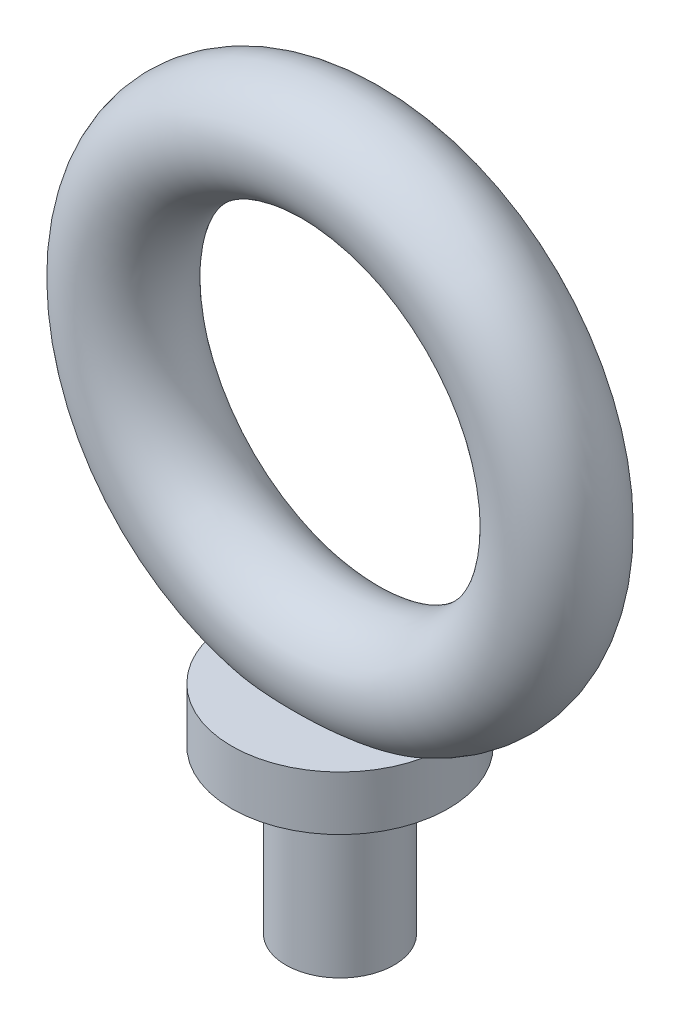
ISO-10303-21;
HEADER;
FILE_DESCRIPTION(('STEP AP214'),'2;1');
FILE_NAME('part.step','',(''),(''),'','','');
FILE_SCHEMA(('AUTOMOTIVE_DESIGN { 1 0 10303 214 1 1 1 1 }'));
ENDSEC;
DATA;
#1=APPLICATION_CONTEXT('core data for automotive mechanical design processes');
#2=APPLICATION_PROTOCOL_DEFINITION('international standard','automotive_design',2000,#1);
#3=PRODUCT_CONTEXT('',#1,'mechanical');
#4=PRODUCT('Part','Part','',(#3));
#5=PRODUCT_RELATED_PRODUCT_CATEGORY('part','',(#4));
#6=PRODUCT_DEFINITION_FORMATION('','',#4);
#7=PRODUCT_DEFINITION_CONTEXT('part definition',#1,'design');
#8=PRODUCT_DEFINITION('design','',#6,#7);
#9=PRODUCT_DEFINITION_SHAPE('','',#8);
#10=(LENGTH_UNIT() NAMED_UNIT(*) SI_UNIT(.MILLI.,.METRE.));
#11=(NAMED_UNIT(*) PLANE_ANGLE_UNIT() SI_UNIT($,.RADIAN.));
#12=(NAMED_UNIT(*) SI_UNIT($,.STERADIAN.) SOLID_ANGLE_UNIT());
#13=UNCERTAINTY_MEASURE_WITH_UNIT(LENGTH_MEASURE(1.E-05),#10,'distance_accuracy_value','');
#14=(GEOMETRIC_REPRESENTATION_CONTEXT(3) GLOBAL_UNCERTAINTY_ASSIGNED_CONTEXT((#13)) GLOBAL_UNIT_ASSIGNED_CONTEXT((#10,
#11,#12)) REPRESENTATION_CONTEXT('',''));
#15=CARTESIAN_POINT('',(0.,0.,0.));
#16=DIRECTION('',(0.,0.,1.));
#17=DIRECTION('',(1.,0.,0.));
#18=AXIS2_PLACEMENT_3D('',#15,#16,#17);
#19=CARTESIAN_POINT('',(0.,19.05,0.));
#20=DIRECTION('',(0.,1.,0.));
#21=DIRECTION('',(0.,0.,1.));
#22=AXIS2_PLACEMENT_3D('',#19,#20,#21);
#23=CYLINDRICAL_SURFACE('',#22,12.7);
#24=CARTESIAN_POINT('',(0.,19.05,0.));
#25=DIRECTION('',(0.,1.,0.));
#26=DIRECTION('',(0.,0.,1.));
#27=AXIS2_PLACEMENT_3D('',#24,#25,#26);
#28=CIRCLE('',#27,12.7);
#29=CARTESIAN_POINT('',(0.,19.05,12.7));
#30=VERTEX_POINT('',#29);
#31=EDGE_CURVE('E77',#30,#30,#28,.T.);
#32=ORIENTED_EDGE('',*,*,#31,.T.);
#33=EDGE_LOOP('',(#32));
#34=FACE_BOUND('',#33,.T.);
#35=CARTESIAN_POINT('',(0.,25.4,0.));
#36=DIRECTION('',(0.,1.,0.));
#37=DIRECTION('',(0.,0.,1.));
#38=AXIS2_PLACEMENT_3D('',#35,#36,#37);
#39=CIRCLE('',#38,12.7);
#40=CARTESIAN_POINT('',(12.4130547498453,25.4,-2.68441274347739));
#41=VERTEX_POINT('',#40);
#42=CARTESIAN_POINT('',(-12.4130547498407,25.4000000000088,-2.68441274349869));
#43=VERTEX_POINT('',#42);
#44=EDGE_CURVE('E73',#41,#43,#39,.T.);
#45=ORIENTED_EDGE('',*,*,#44,.F.);
#46=CARTESIAN_POINT('',(12.4129504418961,25.4002,-2.68489503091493));
#47=CARTESIAN_POINT('',(12.4478696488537,25.3332914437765,-2.52358993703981));
#48=CARTESIAN_POINT('',(12.4801273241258,25.2726602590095,-2.35910719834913));
#49=CARTESIAN_POINT('',(12.5386641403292,25.1641082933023,-2.02496324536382));
#50=CARTESIAN_POINT('',(12.5649432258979,25.1161876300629,-1.85530198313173));
#51=CARTESIAN_POINT('',(12.6108572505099,25.0332307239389,-1.51205162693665));
#52=CARTESIAN_POINT('',(12.6304949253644,24.9981891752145,-1.33846418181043));
#53=CARTESIAN_POINT('',(12.6626879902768,24.941074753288,-0.988529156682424));
#54=CARTESIAN_POINT('',(12.6752437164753,24.9190012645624,-0.812181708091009));
#55=CARTESIAN_POINT('',(12.6929873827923,24.8878788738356,-0.457798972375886));
#56=CARTESIAN_POINT('',(12.6981681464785,24.8788426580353,-0.279762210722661));
#57=CARTESIAN_POINT('',(12.7010189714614,24.8738651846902,0.0765535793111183));
#58=CARTESIAN_POINT('',(12.6986890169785,24.8779239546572,0.254832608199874));
#59=CARTESIAN_POINT('',(12.686576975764,24.8991146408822,0.610193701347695));
#60=CARTESIAN_POINT('',(12.676801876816,24.916234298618,0.787276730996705));
#61=CARTESIAN_POINT('',(12.6500444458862,24.9634617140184,1.13908131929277));
#62=CARTESIAN_POINT('',(12.6330641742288,24.9935657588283,1.31380353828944));
#63=CARTESIAN_POINT('',(12.5883676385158,25.0736953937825,1.69293437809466));
#64=CARTESIAN_POINT('',(12.5592174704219,25.1264332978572,1.89661461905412));
#65=CARTESIAN_POINT('',(12.5089957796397,25.2190406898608,2.19666333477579));
#66=CARTESIAN_POINT('',(12.4911805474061,25.2521446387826,2.29573070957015));
#67=CARTESIAN_POINT('',(12.4535370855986,25.3228249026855,2.49186390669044));
#68=CARTESIAN_POINT('',(12.4337089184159,25.3604010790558,2.58892979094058));
#69=CARTESIAN_POINT('',(12.4129504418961,25.4002,2.6848950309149));
#70=B_SPLINE_CURVE_WITH_KNOTS('',3,(#46,#47,#48,#49,#50,#51,#52,#53,#54,#55,#56,#57,#58,#59,#60,
#61,#62,#63,#64,#65,#66,#67,#68,#69),.UNSPECIFIED.,.F.,.F.,(4,2,2,2,2,2,2,2,2,2,2,4),(0.,
0.534105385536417,1.06821571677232,1.60210576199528,2.13597046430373,2.67035430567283,
3.20473926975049,3.7386232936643,4.27235475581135,4.90837986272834,5.2261489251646,
5.54390814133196),.UNSPECIFIED.);
#71=CARTESIAN_POINT('',(12.4130547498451,25.4,2.68441274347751));
#72=VERTEX_POINT('',#71);
#73=EDGE_CURVE('E60',#41,#72,#70,.T.);
#74=ORIENTED_EDGE('',*,*,#73,.T.);
#75=CARTESIAN_POINT('',(-12.4130547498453,25.4,2.68441274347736));
#76=VERTEX_POINT('',#75);
#77=EDGE_CURVE('E71',#76,#72,#39,.T.);
#78=ORIENTED_EDGE('',*,*,#77,.F.);
#79=CARTESIAN_POINT('',(-12.4129504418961,25.4002,2.6848950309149));
#80=CARTESIAN_POINT('',(-12.4478696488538,25.3332914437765,2.52358993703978));
#81=CARTESIAN_POINT('',(-12.4801273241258,25.2726602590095,2.3591071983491));
#82=CARTESIAN_POINT('',(-12.5386641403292,25.1641082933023,2.02496324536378));
#83=CARTESIAN_POINT('',(-12.5649432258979,25.1161876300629,1.8553019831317));
#84=CARTESIAN_POINT('',(-12.6108572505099,25.0332307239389,1.51205162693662));
#85=CARTESIAN_POINT('',(-12.6304949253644,24.9981891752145,1.3384641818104));
#86=CARTESIAN_POINT('',(-12.6626879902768,24.9410747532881,0.988529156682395));
#87=CARTESIAN_POINT('',(-12.6752437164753,24.9190012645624,0.812181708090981));
#88=CARTESIAN_POINT('',(-12.6929873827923,24.8878788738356,0.457798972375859));
#89=CARTESIAN_POINT('',(-12.6981681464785,24.8788426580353,0.279762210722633));
#90=CARTESIAN_POINT('',(-12.7010189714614,24.8738651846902,-0.0765535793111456));
#91=CARTESIAN_POINT('',(-12.6986890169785,24.8779239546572,-0.254832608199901));
#92=CARTESIAN_POINT('',(-12.686576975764,24.8991146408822,-0.610193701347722));
#93=CARTESIAN_POINT('',(-12.676801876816,24.916234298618,-0.787276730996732));
#94=CARTESIAN_POINT('',(-12.6500444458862,24.9634617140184,-1.13908131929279));
#95=CARTESIAN_POINT('',(-12.6330641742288,24.9935657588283,-1.31380353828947));
#96=CARTESIAN_POINT('',(-12.5883676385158,25.0736953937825,-1.69293437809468));
#97=CARTESIAN_POINT('',(-12.5592174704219,25.1264332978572,-1.89661461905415));
#98=CARTESIAN_POINT('',(-12.5089957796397,25.2190406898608,-2.19666333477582));
#99=CARTESIAN_POINT('',(-12.4911805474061,25.2521446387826,-2.29573070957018));
#100=CARTESIAN_POINT('',(-12.4535370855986,25.3228249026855,-2.49186390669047));
#101=CARTESIAN_POINT('',(-12.4337089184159,25.3604010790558,-2.58892979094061));
#102=CARTESIAN_POINT('',(-12.4129504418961,25.4002,-2.68489503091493));
#103=B_SPLINE_CURVE_WITH_KNOTS('',3,(#79,#80,#81,#82,#83,#84,#85,#86,#87,#88,#89,#90,#91,#92,
#93,#94,#95,#96,#97,#98,#99,#100,#101,#102),.UNSPECIFIED.,.F.,.F.,(4,2,2,2,2,2,2,2,2,2,2,4),(0.,
0.534105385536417,1.06821571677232,1.60210576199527,2.13597046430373,2.67035430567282,
3.20473926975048,3.7386232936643,4.27235475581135,4.90837986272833,5.2261489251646,
5.54390814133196),.UNSPECIFIED.);
#104=EDGE_CURVE('E55',#76,#43,#103,.T.);
#105=ORIENTED_EDGE('',*,*,#104,.T.);
#106=EDGE_LOOP('',(#45,#74,#78,#105));
#107=FACE_BOUND('',#106,.T.);
#108=ADVANCED_FACE('F37',(#34,#107),#23,.T.);
#109=CARTESIAN_POINT('',(0.,25.4,0.));
#110=DIRECTION('',(0.,1.,0.));
#111=DIRECTION('',(0.,0.,1.));
#112=AXIS2_PLACEMENT_3D('',#109,#110,#111);
#113=PLANE('',#112);
#114=ORIENTED_EDGE('',*,*,#44,.T.);
#115=CARTESIAN_POINT('',(0.,25.4,5.49926131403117));
#116=CARTESIAN_POINT('',(-0.500108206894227,25.4,5.4992688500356));
#117=CARTESIAN_POINT('',(-1.00023034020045,25.4,5.49173799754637));
#118=CARTESIAN_POINT('',(-2.00006139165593,25.4,5.46096942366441));
#119=CARTESIAN_POINT('',(-2.49977025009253,25.4,5.43772973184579));
#120=CARTESIAN_POINT('',(-3.49970022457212,25.4,5.37340073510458));
#121=CARTESIAN_POINT('',(-3.99991772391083,25.4,5.33225364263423));
#122=CARTESIAN_POINT('',(-4.99809265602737,25.4,5.22856622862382));
#123=CARTESIAN_POINT('',(-5.49605058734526,25.4,5.16603088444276));
#124=CARTESIAN_POINT('',(-6.38775807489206,25.4,5.02952447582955));
#125=CARTESIAN_POINT('',(-6.78224059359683,25.4,4.9604145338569));
#126=CARTESIAN_POINT('',(-7.56722969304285,25.4,4.80133346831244));
#127=CARTESIAN_POINT('',(-7.95773437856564,25.4,4.71135284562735));
#128=CARTESIAN_POINT('',(-8.73014416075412,25.4,4.50611245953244));
#129=CARTESIAN_POINT('',(-9.11208286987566,25.4,4.39098345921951));
#130=CARTESIAN_POINT('',(-9.67643942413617,25.4,4.19435487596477));
#131=CARTESIAN_POINT('',(-9.86305643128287,25.4,4.12485704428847));
#132=CARTESIAN_POINT('',(-10.2326647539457,25.4,3.97685312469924));
#133=CARTESIAN_POINT('',(-10.4156570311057,25.4,3.89834946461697));
#134=CARTESIAN_POINT('',(-10.7182547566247,25.4,3.75834119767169));
#135=CARTESIAN_POINT('',(-10.8391387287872,25.4,3.69959994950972));
#136=CARTESIAN_POINT('',(-11.0783201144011,25.4,3.57709104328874));
#137=CARTESIAN_POINT('',(-11.1966175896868,25.4,3.51332350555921));
#138=CARTESIAN_POINT('',(-11.5471861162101,25.4,3.31366084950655));
#139=CARTESIAN_POINT('',(-11.7748945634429,25.4,3.16951358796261));
#140=CARTESIAN_POINT('',(-12.2139624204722,25.4,2.85422720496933));
#141=CARTESIAN_POINT('',(-12.4251687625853,25.4,2.68287192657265));
#142=CARTESIAN_POINT('',(-12.8194573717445,25.4,2.31017795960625));
#143=CARTESIAN_POINT('',(-13.0025987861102,25.4,2.10890414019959));
#144=CARTESIAN_POINT('',(-13.2736914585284,25.4,1.74543707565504));
#145=CARTESIAN_POINT('',(-13.3732079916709,25.4,1.59190622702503));
#146=CARTESIAN_POINT('',(-13.5473593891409,25.4,1.27106689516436));
#147=CARTESIAN_POINT('',(-13.622013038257,25.4,1.10376893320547));
#148=CARTESIAN_POINT('',(-13.7111925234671,25.4,0.844092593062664));
#149=CARTESIAN_POINT('',(-13.7371987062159,25.4,0.755561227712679));
#150=CARTESIAN_POINT('',(-13.7807325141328,25.4,0.576454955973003));
#151=CARTESIAN_POINT('',(-13.7982644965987,25.4,0.485881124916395));
#152=CARTESIAN_POINT('',(-13.8243637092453,25.4,0.303485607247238));
#153=CARTESIAN_POINT('',(-13.8329351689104,25.4,0.211664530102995));
#154=CARTESIAN_POINT('',(-13.840899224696,25.4,0.0276551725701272));
#155=CARTESIAN_POINT('',(-13.8402928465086,25.4,-0.0645330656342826));
#156=CARTESIAN_POINT('',(-13.8259940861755,25.4,-0.316727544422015));
#157=CARTESIAN_POINT('',(-13.8029245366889,25.4,-0.476292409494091));
#158=CARTESIAN_POINT('',(-13.7307497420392,25.4,-0.789274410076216));
#159=CARTESIAN_POINT('',(-13.6816328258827,25.4,-0.942688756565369));
#160=CARTESIAN_POINT('',(-13.5443700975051,25.4,-1.28113886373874));
#161=CARTESIAN_POINT('',(-13.4492188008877,25.4,-1.46332518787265));
#162=CARTESIAN_POINT('',(-13.2307712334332,25.4,-1.80987781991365));
#163=CARTESIAN_POINT('',(-13.1074203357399,25.4,-1.97420861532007));
#164=CARTESIAN_POINT('',(-12.7714172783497,25.4,-2.36444467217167));
#165=CARTESIAN_POINT('',(-12.5453803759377,25.4,-2.57879252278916));
#166=CARTESIAN_POINT('',(-12.1845698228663,25.4,-2.87256886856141));
#167=CARTESIAN_POINT('',(-12.0604932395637,25.4,-2.96597632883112));
#168=CARTESIAN_POINT('',(-11.8064129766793,25.4,-3.14437423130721));
#169=CARTESIAN_POINT('',(-11.6764104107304,25.4,-3.22936624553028));
#170=CARTESIAN_POINT('',(-11.299523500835,25.4,-3.46046379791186));
#171=CARTESIAN_POINT('',(-11.0469672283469,25.4,-3.59730880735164));
#172=CARTESIAN_POINT('',(-10.5310988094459,25.4,-3.84906316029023));
#173=CARTESIAN_POINT('',(-10.2677770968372,25.4,-3.96395245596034));
#174=CARTESIAN_POINT('',(-9.73307434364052,25.4,-4.1755192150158));
#175=CARTESIAN_POINT('',(-9.46167136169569,25.4,-4.2721406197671));
#176=CARTESIAN_POINT('',(-8.91394027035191,25.4,-4.44959652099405));
#177=CARTESIAN_POINT('',(-8.63761428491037,25.4,-4.53043765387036));
#178=CARTESIAN_POINT('',(-8.1450986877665,25.4,-4.66175677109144));
#179=CARTESIAN_POINT('',(-7.92962211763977,25.4,-4.71494918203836));
#180=CARTESIAN_POINT('',(-7.49703927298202,25.4,-4.81426811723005));
#181=CARTESIAN_POINT('',(-7.27993288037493,25.4,-4.86039412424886));
#182=CARTESIAN_POINT('',(-6.62657895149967,25.4,-4.98939747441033));
#183=CARTESIAN_POINT('',(-6.18846293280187,25.4,-5.06285724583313));
#184=CARTESIAN_POINT('',(-5.3084668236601,25.4,-5.18973436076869));
#185=CARTESIAN_POINT('',(-4.86658060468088,25.4,-5.24310760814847));
#186=CARTESIAN_POINT('',(-3.98122751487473,25.4,-5.33315213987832));
#187=CARTESIAN_POINT('',(-3.53776097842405,25.4,-5.36982676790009));
#188=CARTESIAN_POINT('',(-2.64889841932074,25.4,-5.42904612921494));
#189=CARTESIAN_POINT('',(-2.20350030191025,25.4,-5.45155859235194));
#190=CARTESIAN_POINT('',(-1.31222477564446,25.4,-5.48387718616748));
#191=CARTESIAN_POINT('',(-0.866347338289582,25.4,-5.49368251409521));
#192=CARTESIAN_POINT('',(0.0249374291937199,25.4,-5.50126189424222));
#193=CARTESIAN_POINT('',(0.47034463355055,25.4,-5.49905127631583));
#194=CARTESIAN_POINT('',(1.36090411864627,25.4,-5.48248446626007));
#195=CARTESIAN_POINT('',(1.80605641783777,25.4,-5.46812930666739));
#196=CARTESIAN_POINT('',(2.61332533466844,25.4,-5.43014377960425));
#197=CARTESIAN_POINT('',(2.97554583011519,25.4,-5.40872462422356));
#198=CARTESIAN_POINT('',(3.6993333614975,25.4,-5.35616771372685));
#199=CARTESIAN_POINT('',(4.06090032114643,25.4,-5.32502888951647));
#200=CARTESIAN_POINT('',(4.78237970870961,25.4,-5.25169125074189));
#201=CARTESIAN_POINT('',(5.14229380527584,25.4,-5.20950910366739));
#202=CARTESIAN_POINT('',(5.86036192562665,25.4,-5.11219182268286));
#203=CARTESIAN_POINT('',(6.21851609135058,25.4,-5.05705775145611));
#204=CARTESIAN_POINT('',(6.93474497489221,25.4,-4.93093779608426));
#205=CARTESIAN_POINT('',(7.2928003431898,25.4,-4.8598400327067));
#206=CARTESIAN_POINT('',(8.00482913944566,25.4,-4.69878318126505));
#207=CARTESIAN_POINT('',(8.35880108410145,25.4,-4.60881745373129));
#208=CARTESIAN_POINT('',(9.06104922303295,25.4,-4.40565459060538));
#209=CARTESIAN_POINT('',(9.40931118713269,25.4,-4.29240682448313));
#210=CARTESIAN_POINT('',(9.9236340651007,25.4,-4.10120041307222));
#211=CARTESIAN_POINT('',(10.0936838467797,25.4,-4.03393081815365));
#212=CARTESIAN_POINT('',(10.4304002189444,25.4,-3.8914308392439));
#213=CARTESIAN_POINT('',(10.5970673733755,25.4,-3.81620179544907));
#214=CARTESIAN_POINT('',(10.9638005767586,25.4,-3.63860164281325));
#215=CARTESIAN_POINT('',(11.1627800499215,25.4,-3.53395919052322));
#216=CARTESIAN_POINT('',(11.5520339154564,25.4,-3.3091876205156));
#217=CARTESIAN_POINT('',(11.7423035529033,25.4,-3.18905017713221));
#218=CARTESIAN_POINT('',(12.1092298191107,25.4,-2.9320793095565));
#219=CARTESIAN_POINT('',(12.2859781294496,25.4,-2.79537835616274));
#220=CARTESIAN_POINT('',(12.6223578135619,25.4,-2.50254830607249));
#221=CARTESIAN_POINT('',(12.7820197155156,25.4,-2.34645497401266));
#222=CARTESIAN_POINT('',(13.0508809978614,25.4,-2.04317157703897));
#223=CARTESIAN_POINT('',(13.1639847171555,25.4,-1.89947529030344));
#224=CARTESIAN_POINT('',(13.3693197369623,25.4,-1.59758278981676));
#225=CARTESIAN_POINT('',(13.4615463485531,25.4,-1.43938332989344));
#226=CARTESIAN_POINT('',(13.6199600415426,25.4,-1.10827978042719));
#227=CARTESIAN_POINT('',(13.6858837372,25.4,-0.93524705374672));
#228=CARTESIAN_POINT('',(13.7843853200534,25.4,-0.579936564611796));
#229=CARTESIAN_POINT('',(13.8170063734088,25.4,-0.397671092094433));
#230=CARTESIAN_POINT('',(13.8442889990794,25.4,-0.0452958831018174));
#231=CARTESIAN_POINT('',(13.8418318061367,25.4,0.124591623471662));
#232=CARTESIAN_POINT('',(13.8061631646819,25.4,0.461094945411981));
#233=CARTESIAN_POINT('',(13.7729445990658,25.4,0.627709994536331));
#234=CARTESIAN_POINT('',(13.6818970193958,25.4,0.942115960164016));
#235=CARTESIAN_POINT('',(13.6258165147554,25.4,1.09042565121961));
#236=CARTESIAN_POINT('',(13.4931858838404,25.4,1.37747924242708));
#237=CARTESIAN_POINT('',(13.4166291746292,25.4,1.51622004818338));
#238=CARTESIAN_POINT('',(13.1965944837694,25.4,1.86203133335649));
#239=CARTESIAN_POINT('',(13.0403243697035,25.4,2.06094999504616));
#240=CARTESIAN_POINT('',(12.6986653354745,25.4,2.43201584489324));
#241=CARTESIAN_POINT('',(12.513196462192,25.4,2.60408686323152));
#242=CARTESIAN_POINT('',(12.1536509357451,25.4,2.89845468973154));
#243=CARTESIAN_POINT('',(11.9824363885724,25.4,3.02431705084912));
#244=CARTESIAN_POINT('',(11.629706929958,25.4,3.26082141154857));
#245=CARTESIAN_POINT('',(11.4481844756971,25.4,3.37145205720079));
#246=CARTESIAN_POINT('',(11.0772845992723,25.4,3.5794357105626));
#247=CARTESIAN_POINT('',(10.8878922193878,25.4,3.67676177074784));
#248=CARTESIAN_POINT('',(10.5035592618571,25.4,3.85950520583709));
#249=CARTESIAN_POINT('',(10.3086201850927,25.4,3.94492576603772));
#250=CARTESIAN_POINT('',(9.85435277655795,25.4,4.1298326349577));
#251=CARTESIAN_POINT('',(9.59353662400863,25.4,4.22565110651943));
#252=CARTESIAN_POINT('',(9.06680984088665,25.4,4.40224109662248));
#253=CARTESIAN_POINT('',(8.80089708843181,25.4,4.48300619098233));
#254=CARTESIAN_POINT('',(8.26508000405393,25.4,4.63176754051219));
#255=CARTESIAN_POINT('',(7.99516977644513,25.4,4.69974236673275));
#256=CARTESIAN_POINT('',(7.45285400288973,25.4,4.82456407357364));
#257=CARTESIAN_POINT('',(7.18044880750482,25.4,4.88141249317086));
#258=CARTESIAN_POINT('',(6.6329127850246,25.4,4.98566272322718));
#259=CARTESIAN_POINT('',(6.35777590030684,25.4,5.03303242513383));
#260=CARTESIAN_POINT('',(5.8061861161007,25.4,5.11933400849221));
#261=CARTESIAN_POINT('',(5.52973317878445,25.4,5.1582656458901));
#262=CARTESIAN_POINT('',(4.97613558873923,25.4,5.2286807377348));
#263=CARTESIAN_POINT('',(4.69899175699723,25.4,5.2601707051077));
#264=CARTESIAN_POINT('',(4.14403393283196,25.4,5.31657528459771));
#265=CARTESIAN_POINT('',(3.8662199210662,25.4,5.34148970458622));
#266=CARTESIAN_POINT('',(3.2893799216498,25.4,5.38704180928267));
#267=CARTESIAN_POINT('',(2.99031801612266,25.4,5.40722163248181));
#268=CARTESIAN_POINT('',(2.39184168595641,25.4,5.44137422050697));
#269=CARTESIAN_POINT('',(2.09242725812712,25.4,5.45534692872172));
#270=CARTESIAN_POINT('',(1.49422437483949,25.4,5.47748992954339));
#271=CARTESIAN_POINT('',(1.19543651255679,25.4,5.48567635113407));
#272=CARTESIAN_POINT('',(0.597767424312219,25.4,5.49655976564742));
#273=CARTESIAN_POINT('',(0.298886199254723,25.4,5.49925681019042));
#274=CARTESIAN_POINT('',(0.,25.4,5.49926131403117));
#275=B_SPLINE_CURVE_WITH_KNOTS('',3,(#115,#116,#117,#118,#119,#120,#121,#122,#123,#124,#125,
#126,#127,#128,#129,#130,#131,#132,#133,#134,#135,#136,#137,#138,#139,#140,#141,#142,#143,#144,
#145,#146,#147,#148,#149,#150,#151,#152,#153,#154,#155,#156,#157,#158,#159,#160,#161,#162,#163,
#164,#165,#166,#167,#168,#169,#170,#171,#172,#173,#174,#175,#176,#177,#178,#179,#180,#181,#182,
#183,#184,#185,#186,#187,#188,#189,#190,#191,#192,#193,#194,#195,#196,#197,#198,#199,#200,#201,
#202,#203,#204,#205,#206,#207,#208,#209,#210,#211,#212,#213,#214,#215,#216,#217,#218,#219,#220,
#221,#222,#223,#224,#225,#226,#227,#228,#229,#230,#231,#232,#233,#234,#235,#236,#237,#238,#239,
#240,#241,#242,#243,#244,#245,#246,#247,#248,#249,#250,#251,#252,#253,#254,#255,#256,#257,#258,
#259,#260,#261,#262,#263,#264,#265,#266,#267,#268,#269,#270,#271,#272,#273,#274),.UNSPECIFIED.,
.T.,.F.,(4,2,2,2,2,2,2,2,2,2,2,2,2,2,2,2,2,2,2,2,2,2,2,2,2,2,2,2,2,2,2,2,2,2,2,2,2,2,2,2,2,2,2,
2,2,2,2,2,2,2,2,2,2,2,2,2,2,2,2,2,2,2,2,2,2,2,2,2,2,2,2,2,2,2,2,2,2,2,2,4),(0.,1.50028938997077,
3.00076700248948,4.50612301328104,6.01112894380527,7.21214767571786,8.41371411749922,
9.60917554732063,10.2064047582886,10.8034733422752,11.2065630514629,11.6096431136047,
12.4165864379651,13.230294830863,14.0422640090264,14.5894247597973,15.1361711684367,
15.4126400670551,15.6889666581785,15.9651627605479,16.2413279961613,16.7224350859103,
17.2037579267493,17.8169262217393,18.4312925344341,19.3602443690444,19.8259674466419,
20.2916033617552,21.1519117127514,22.0130018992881,22.8766930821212,23.7400202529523,
24.4057305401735,25.071489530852,26.4035217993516,27.738461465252,29.0731337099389,
30.4108362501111,31.7486232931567,33.0847039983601,34.4206711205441,35.5091186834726,
36.5976860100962,37.6846197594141,38.7714643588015,39.8661778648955,40.961277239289,
42.0587837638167,42.6072320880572,43.1555882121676,43.8294505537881,44.5036764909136,
45.1728277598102,45.8407627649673,46.3879209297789,46.935201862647,47.487833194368,
48.0397473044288,48.546609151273,49.0535882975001,49.5274652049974,50.0014946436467,
50.7560473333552,51.5127033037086,52.149295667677,52.7863600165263,53.4246961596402,
54.0628611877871,54.8958617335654,55.7292169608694,56.5639562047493,57.3985799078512,
58.2359846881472,59.0734136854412,59.9101070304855,60.7468248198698,61.6459789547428,
62.5451412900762,63.4417872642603,64.338424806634),.UNSPECIFIED.);
#276=EDGE_CURVE('E12',#43,#41,#275,.T.);
#277=ORIENTED_EDGE('',*,*,#276,.T.);
#278=EDGE_LOOP('',(#114,#277));
#279=FACE_BOUND('',#278,.T.);
#280=ADVANCED_FACE('F102',(#279),#113,.T.);
#281=ORIENTED_EDGE('',*,*,#77,.T.);
#282=EDGE_CURVE('E41',#72,#76,#275,.T.);
#283=ORIENTED_EDGE('',*,*,#282,.T.);
#284=EDGE_LOOP('',(#281,#283));
#285=FACE_BOUND('',#284,.T.);
#286=ADVANCED_FACE('F75',(#285),#113,.T.);
#287=CARTESIAN_POINT('',(0.,25.4,0.));
#288=DIRECTION('',(0.,-1.,0.));
#289=DIRECTION('',(0.,0.,-1.));
#290=AXIS2_PLACEMENT_3D('',#287,#288,#289);
#291=CYLINDRICAL_SURFACE('',#290,6.35);
#292=CARTESIAN_POINT('',(0.,0.,0.));
#293=DIRECTION('',(0.,1.,0.));
#294=DIRECTION('',(0.,0.,1.));
#295=AXIS2_PLACEMENT_3D('',#292,#293,#294);
#296=CIRCLE('',#295,6.35);
#297=CARTESIAN_POINT('',(0.,0.,6.35));
#298=VERTEX_POINT('',#297);
#299=EDGE_CURVE('E86',#298,#298,#296,.T.);
#300=ORIENTED_EDGE('',*,*,#299,.T.);
#301=EDGE_LOOP('',(#300));
#302=FACE_BOUND('',#301,.T.);
#303=CARTESIAN_POINT('',(0.,19.05,0.));
#304=DIRECTION('',(0.,1.,0.));
#305=DIRECTION('',(0.,0.,1.));
#306=AXIS2_PLACEMENT_3D('',#303,#304,#305);
#307=CIRCLE('',#306,6.35);
#308=CARTESIAN_POINT('',(0.,19.05,6.35));
#309=VERTEX_POINT('',#308);
#310=EDGE_CURVE('E68',#309,#309,#307,.T.);
#311=ORIENTED_EDGE('',*,*,#310,.F.);
#312=EDGE_LOOP('',(#311));
#313=FACE_BOUND('',#312,.T.);
#314=ADVANCED_FACE('F39',(#302,#313),#291,.T.);
#315=CARTESIAN_POINT('',(0.,0.,0.));
#316=DIRECTION('',(0.,1.,0.));
#317=DIRECTION('',(0.,0.,1.));
#318=AXIS2_PLACEMENT_3D('',#315,#316,#317);
#319=PLANE('',#318);
#320=ORIENTED_EDGE('',*,*,#299,.F.);
#321=EDGE_LOOP('',(#320));
#322=FACE_BOUND('',#321,.T.);
#323=ADVANCED_FACE('F94',(#322),#319,.F.);
#324=CARTESIAN_POINT('',(0.,19.05,0.));
#325=DIRECTION('',(0.,1.,0.));
#326=DIRECTION('',(0.,0.,1.));
#327=AXIS2_PLACEMENT_3D('',#324,#325,#326);
#328=PLANE('',#327);
#329=ORIENTED_EDGE('',*,*,#31,.F.);
#330=EDGE_LOOP('',(#329));
#331=FACE_BOUND('',#330,.T.);
#332=ORIENTED_EDGE('',*,*,#310,.T.);
#333=EDGE_LOOP('',(#332));
#334=FACE_BOUND('',#333,.T.);
#335=ADVANCED_FACE('F91',(#331,#334),#328,.F.);
#336=CARTESIAN_POINT('',(0.,53.975,0.));
#337=DIRECTION('',(0.,0.,-1.));
#338=DIRECTION('',(-1.,0.,0.));
#339=AXIS2_PLACEMENT_3D('',#336,#337,#338);
#340=TOROIDAL_SURFACE('',#339,25.4,6.35);
#341=ORIENTED_EDGE('',*,*,#276,.F.);
#342=ORIENTED_EDGE('',*,*,#104,.F.);
#343=ORIENTED_EDGE('',*,*,#282,.F.);
#344=ORIENTED_EDGE('',*,*,#73,.F.);
#345=EDGE_LOOP('',(#341,#342,#343,#344));
#346=FACE_BOUND('',#345,.T.);
#347=ADVANCED_FACE('F64',(#346),#340,.T.);
#348=CLOSED_SHELL('',(#108,#280,#286,#314,#323,#335,#347));
#349=MANIFOLD_SOLID_BREP('B2',#348);
#350=ADVANCED_BREP_SHAPE_REPRESENTATION('',(#18,#349),#14);
#351=SHAPE_DEFINITION_REPRESENTATION(#9,#350);
ENDSEC;
END-ISO-10303-21;
